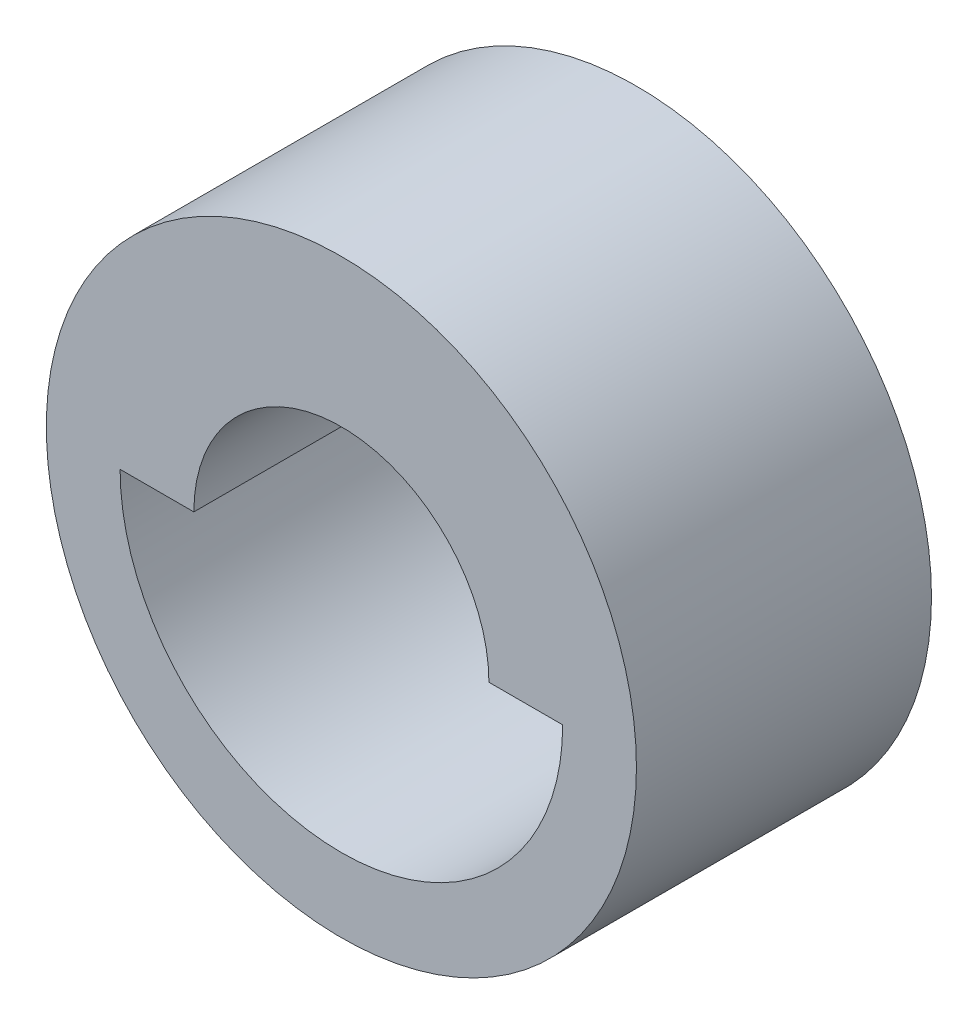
ISO-10303-21;
HEADER;
FILE_DESCRIPTION(('STEP AP214'),'2;1');
FILE_NAME('part.step','',(''),(''),'','','');
FILE_SCHEMA(('AUTOMOTIVE_DESIGN { 1 0 10303 214 1 1 1 1 }'));
ENDSEC;
DATA;
#1=APPLICATION_CONTEXT('core data for automotive mechanical design processes');
#2=APPLICATION_PROTOCOL_DEFINITION('international standard','automotive_design',2000,#1);
#3=PRODUCT_CONTEXT('',#1,'mechanical');
#4=PRODUCT('Part','Part','',(#3));
#5=PRODUCT_RELATED_PRODUCT_CATEGORY('part','',(#4));
#6=PRODUCT_DEFINITION_FORMATION('','',#4);
#7=PRODUCT_DEFINITION_CONTEXT('part definition',#1,'design');
#8=PRODUCT_DEFINITION('design','',#6,#7);
#9=PRODUCT_DEFINITION_SHAPE('','',#8);
#10=(LENGTH_UNIT() NAMED_UNIT(*) SI_UNIT(.MILLI.,.METRE.));
#11=(NAMED_UNIT(*) PLANE_ANGLE_UNIT() SI_UNIT($,.RADIAN.));
#12=(NAMED_UNIT(*) SI_UNIT($,.STERADIAN.) SOLID_ANGLE_UNIT());
#13=UNCERTAINTY_MEASURE_WITH_UNIT(LENGTH_MEASURE(1.E-05),#10,'distance_accuracy_value','');
#14=(GEOMETRIC_REPRESENTATION_CONTEXT(3) GLOBAL_UNCERTAINTY_ASSIGNED_CONTEXT((#13)) GLOBAL_UNIT_ASSIGNED_CONTEXT((#10,
#11,#12)) REPRESENTATION_CONTEXT('',''));
#15=CARTESIAN_POINT('',(0.,0.,0.));
#16=DIRECTION('',(0.,0.,1.));
#17=DIRECTION('',(1.,0.,0.));
#18=AXIS2_PLACEMENT_3D('',#15,#16,#17);
#19=CARTESIAN_POINT('',(0.,0.,50.8));
#20=DIRECTION('',(0.,0.,1.));
#21=DIRECTION('',(1.,0.,0.));
#22=AXIS2_PLACEMENT_3D('',#19,#20,#21);
#23=PLANE('',#22);
#24=CARTESIAN_POINT('',(0.,0.,50.8));
#25=DIRECTION('',(0.,0.,1.));
#26=DIRECTION('',(1.,0.,0.));
#27=AXIS2_PLACEMENT_3D('',#24,#25,#26);
#28=CIRCLE('',#27,50.8);
#29=CARTESIAN_POINT('',(50.8,0.,50.8));
#30=VERTEX_POINT('',#29);
#31=EDGE_CURVE('E11',#30,#30,#28,.T.);
#32=ORIENTED_EDGE('',*,*,#31,.T.);
#33=EDGE_LOOP('',(#32));
#34=FACE_BOUND('',#33,.T.);
#35=CARTESIAN_POINT('',(0.,0.,50.8));
#36=DIRECTION('',(0.,0.,1.));
#37=DIRECTION('',(1.,0.,0.));
#38=AXIS2_PLACEMENT_3D('',#35,#36,#37);
#39=CIRCLE('',#38,38.1);
#40=CARTESIAN_POINT('',(-38.1,2.66050878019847E-13,50.8));
#41=VERTEX_POINT('',#40);
#42=CARTESIAN_POINT('',(38.1,0.,50.8));
#43=VERTEX_POINT('',#42);
#44=EDGE_CURVE('E77',#41,#43,#39,.T.);
#45=ORIENTED_EDGE('',*,*,#44,.F.);
#46=DIRECTION('',(-1.,0.,0.));
#47=VECTOR('',#46,1.);
#48=CARTESIAN_POINT('',(-38.1,2.66050878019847E-13,50.8));
#49=LINE('',#48,#47);
#50=CARTESIAN_POINT('',(-25.4,1.77367252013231E-13,50.8));
#51=VERTEX_POINT('',#50);
#52=EDGE_CURVE('E94',#51,#41,#49,.T.);
#53=ORIENTED_EDGE('',*,*,#52,.F.);
#54=CARTESIAN_POINT('',(0.,0.,50.8));
#55=DIRECTION('',(0.,0.,1.));
#56=DIRECTION('',(1.,0.,0.));
#57=AXIS2_PLACEMENT_3D('',#54,#55,#56);
#58=CIRCLE('',#57,25.4);
#59=CARTESIAN_POINT('',(25.4,0.,50.8));
#60=VERTEX_POINT('',#59);
#61=EDGE_CURVE('E92',#60,#51,#58,.T.);
#62=ORIENTED_EDGE('',*,*,#61,.F.);
#63=DIRECTION('',(1.,0.,0.));
#64=VECTOR('',#63,1.);
#65=CARTESIAN_POINT('',(38.1,0.,50.8));
#66=LINE('',#65,#64);
#67=EDGE_CURVE('E47',#60,#43,#66,.T.);
#68=ORIENTED_EDGE('',*,*,#67,.T.);
#69=EDGE_LOOP('',(#45,#53,#62,#68));
#70=FACE_BOUND('',#69,.T.);
#71=ADVANCED_FACE('F32',(#34,#70),#23,.T.);
#72=CARTESIAN_POINT('',(0.,0.,0.));
#73=DIRECTION('',(0.,0.,1.));
#74=DIRECTION('',(1.,0.,0.));
#75=AXIS2_PLACEMENT_3D('',#72,#73,#74);
#76=PLANE('',#75);
#77=CARTESIAN_POINT('',(0.,0.,0.));
#78=DIRECTION('',(0.,0.,1.));
#79=DIRECTION('',(1.,0.,0.));
#80=AXIS2_PLACEMENT_3D('',#77,#78,#79);
#81=CIRCLE('',#80,50.8);
#82=CARTESIAN_POINT('',(50.8,0.,0.));
#83=VERTEX_POINT('',#82);
#84=EDGE_CURVE('E36',#83,#83,#81,.T.);
#85=ORIENTED_EDGE('',*,*,#84,.F.);
#86=EDGE_LOOP('',(#85));
#87=FACE_BOUND('',#86,.T.);
#88=DIRECTION('',(1.,0.,0.));
#89=VECTOR('',#88,1.);
#90=CARTESIAN_POINT('',(-38.1,2.66050878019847E-13,0.));
#91=LINE('',#90,#89);
#92=CARTESIAN_POINT('',(-38.1,2.66050878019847E-13,0.));
#93=VERTEX_POINT('',#92);
#94=CARTESIAN_POINT('',(-25.4,1.77367252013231E-13,0.));
#95=VERTEX_POINT('',#94);
#96=EDGE_CURVE('E89',#93,#95,#91,.T.);
#97=ORIENTED_EDGE('',*,*,#96,.F.);
#98=CARTESIAN_POINT('',(0.,0.,0.));
#99=DIRECTION('',(0.,0.,1.));
#100=DIRECTION('',(1.,0.,0.));
#101=AXIS2_PLACEMENT_3D('',#98,#99,#100);
#102=CIRCLE('',#101,38.1);
#103=CARTESIAN_POINT('',(38.1,0.,0.));
#104=VERTEX_POINT('',#103);
#105=EDGE_CURVE('E75',#93,#104,#102,.T.);
#106=ORIENTED_EDGE('',*,*,#105,.T.);
#107=DIRECTION('',(-1.,0.,0.));
#108=VECTOR('',#107,1.);
#109=CARTESIAN_POINT('',(38.1,0.,0.));
#110=LINE('',#109,#108);
#111=CARTESIAN_POINT('',(25.4,0.,0.));
#112=VERTEX_POINT('',#111);
#113=EDGE_CURVE('E78',#104,#112,#110,.T.);
#114=ORIENTED_EDGE('',*,*,#113,.T.);
#115=CARTESIAN_POINT('',(0.,0.,0.));
#116=DIRECTION('',(0.,0.,1.));
#117=DIRECTION('',(1.,0.,0.));
#118=AXIS2_PLACEMENT_3D('',#115,#116,#117);
#119=CIRCLE('',#118,25.4);
#120=EDGE_CURVE('E90',#112,#95,#119,.T.);
#121=ORIENTED_EDGE('',*,*,#120,.T.);
#122=EDGE_LOOP('',(#97,#106,#114,#121));
#123=FACE_BOUND('',#122,.T.);
#124=ADVANCED_FACE('F88',(#87,#123),#76,.F.);
#125=CARTESIAN_POINT('',(0.,0.,50.8));
#126=DIRECTION('',(0.,0.,-1.));
#127=DIRECTION('',(-1.,0.,0.));
#128=AXIS2_PLACEMENT_3D('',#125,#126,#127);
#129=CYLINDRICAL_SURFACE('',#128,25.4);
#130=ORIENTED_EDGE('',*,*,#61,.T.);
#131=DIRECTION('',(0.,0.,1.));
#132=VECTOR('',#131,1.);
#133=CARTESIAN_POINT('',(-25.4,1.77367252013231E-13,50.8));
#134=LINE('',#133,#132);
#135=EDGE_CURVE('E173',#95,#51,#134,.T.);
#136=ORIENTED_EDGE('',*,*,#135,.F.);
#137=ORIENTED_EDGE('',*,*,#120,.F.);
#138=DIRECTION('',(0.,0.,1.));
#139=VECTOR('',#138,1.);
#140=CARTESIAN_POINT('',(25.4,0.,50.8));
#141=LINE('',#140,#139);
#142=EDGE_CURVE('E82',#112,#60,#141,.T.);
#143=ORIENTED_EDGE('',*,*,#142,.T.);
#144=EDGE_LOOP('',(#130,#136,#137,#143));
#145=FACE_BOUND('',#144,.T.);
#146=ADVANCED_FACE('F107',(#145),#129,.F.);
#147=CARTESIAN_POINT('',(0.,0.,50.8));
#148=DIRECTION('',(0.,0.,-1.));
#149=DIRECTION('',(-1.,0.,0.));
#150=AXIS2_PLACEMENT_3D('',#147,#148,#149);
#151=CYLINDRICAL_SURFACE('',#150,50.8);
#152=ORIENTED_EDGE('',*,*,#31,.F.);
#153=EDGE_LOOP('',(#152));
#154=FACE_BOUND('',#153,.T.);
#155=ORIENTED_EDGE('',*,*,#84,.T.);
#156=EDGE_LOOP('',(#155));
#157=FACE_BOUND('',#156,.T.);
#158=ADVANCED_FACE('F34',(#154,#157),#151,.T.);
#159=CARTESIAN_POINT('',(0.,0.,65.2805789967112));
#160=DIRECTION('',(0.,0.,1.));
#161=DIRECTION('',(1.,0.,0.));
#162=AXIS2_PLACEMENT_3D('',#159,#160,#161);
#163=CYLINDRICAL_SURFACE('',#162,38.1);
#164=ORIENTED_EDGE('',*,*,#105,.F.);
#165=DIRECTION('',(0.,0.,-1.));
#166=VECTOR('',#165,1.);
#167=CARTESIAN_POINT('',(-38.1,2.66050878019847E-13,50.8));
#168=LINE('',#167,#166);
#169=EDGE_CURVE('E55',#41,#93,#168,.T.);
#170=ORIENTED_EDGE('',*,*,#169,.F.);
#171=ORIENTED_EDGE('',*,*,#44,.T.);
#172=DIRECTION('',(0.,0.,-1.));
#173=VECTOR('',#172,1.);
#174=CARTESIAN_POINT('',(38.1,0.,50.8));
#175=LINE('',#174,#173);
#176=EDGE_CURVE('E71',#43,#104,#175,.T.);
#177=ORIENTED_EDGE('',*,*,#176,.T.);
#178=EDGE_LOOP('',(#164,#170,#171,#177));
#179=FACE_BOUND('',#178,.T.);
#180=ADVANCED_FACE('F73',(#179),#163,.F.);
#181=CARTESIAN_POINT('',(0.,0.,0.));
#182=DIRECTION('',(0.,-1.,0.));
#183=DIRECTION('',(0.,0.,1.));
#184=AXIS2_PLACEMENT_3D('',#181,#182,#183);
#185=PLANE('',#184);
#186=ORIENTED_EDGE('',*,*,#169,.T.);
#187=ORIENTED_EDGE('',*,*,#96,.T.);
#188=ORIENTED_EDGE('',*,*,#135,.T.);
#189=ORIENTED_EDGE('',*,*,#52,.T.);
#190=EDGE_LOOP('',(#186,#187,#188,#189));
#191=FACE_BOUND('',#190,.T.);
#192=ADVANCED_FACE('F118',(#191),#185,.T.);
#193=CARTESIAN_POINT('',(0.,0.,0.));
#194=DIRECTION('',(0.,1.,0.));
#195=DIRECTION('',(0.,0.,1.));
#196=AXIS2_PLACEMENT_3D('',#193,#194,#195);
#197=PLANE('',#196);
#198=ORIENTED_EDGE('',*,*,#176,.F.);
#199=ORIENTED_EDGE('',*,*,#67,.F.);
#200=ORIENTED_EDGE('',*,*,#142,.F.);
#201=ORIENTED_EDGE('',*,*,#113,.F.);
#202=EDGE_LOOP('',(#198,#199,#200,#201));
#203=FACE_BOUND('',#202,.T.);
#204=ADVANCED_FACE('F81',(#203),#197,.F.);
#205=CLOSED_SHELL('',(#71,#124,#146,#158,#180,#192,#204));
#206=MANIFOLD_SOLID_BREP('B2',#205);
#207=ADVANCED_BREP_SHAPE_REPRESENTATION('',(#18,#206),#14);
#208=SHAPE_DEFINITION_REPRESENTATION(#9,#207);
ENDSEC;
END-ISO-10303-21;
